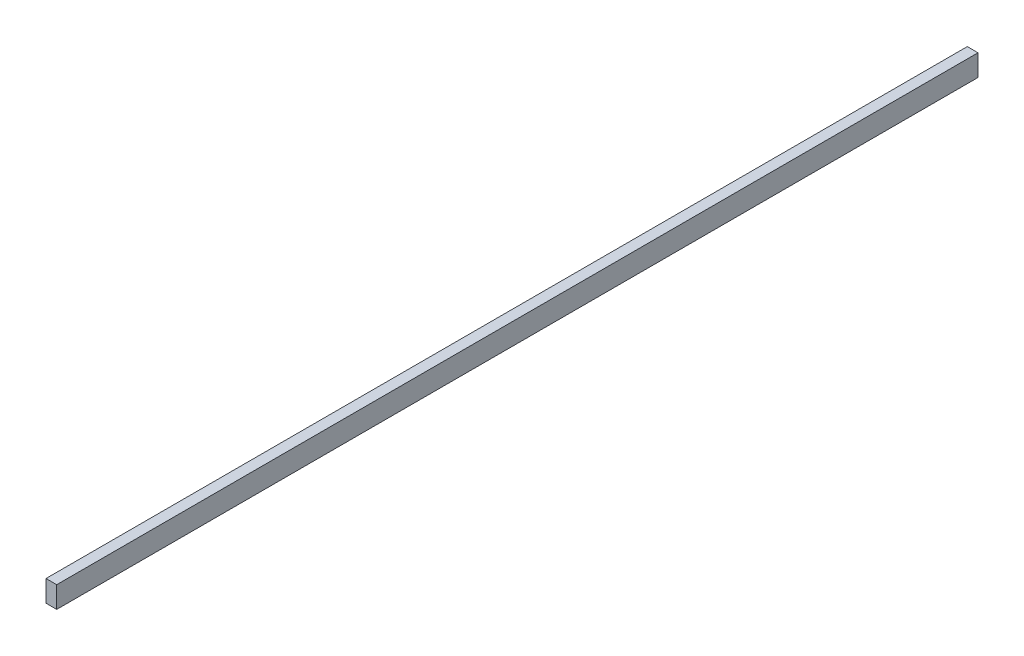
from build123d import *

# Parameters (mm, degrees)
ESQUISSE1_W      = 5
ESQUISSE1_H      = 10
EXTRUSION1_DEPTH = 430


with BuildPart() as part:
    # Esquisse1 → Extrusion1 (new body)
    with BuildSketch(Plane.XY):
        with Locations((2.5, 5)):
            Rectangle(ESQUISSE1_W, ESQUISSE1_H)
    extrude(amount=EXTRUSION1_DEPTH)


solid = part.part
